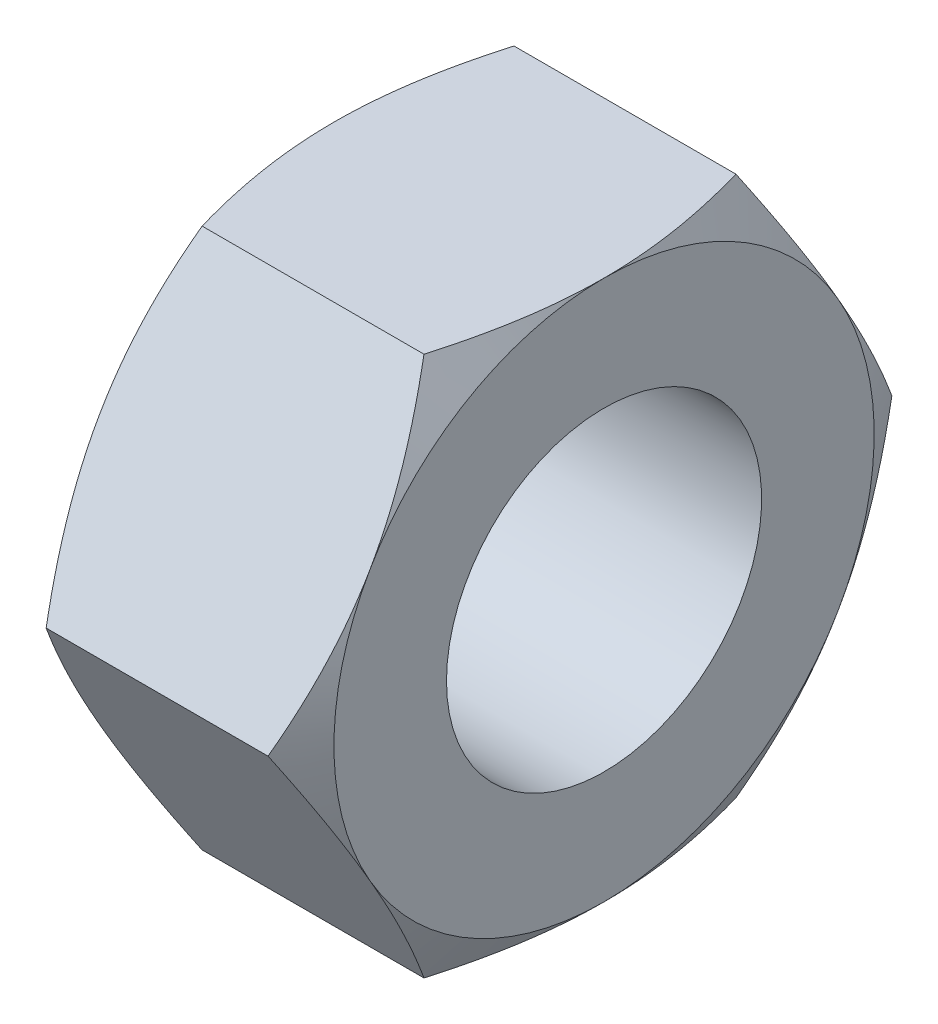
from build123d import *

# Parameters (mm, degrees)
SKETCH_H_OUTSIDE_W = 37.912
SKETCH_H_OUTSIDE_H = 37.912
HEXAGONE_DEPTH     = 23.978740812


with BuildPart() as part:
    # Contour → Base-R_volution (revolve)
    with BuildSketch(Plane.XY, mode=Mode.PRIVATE) as base_r_volution_sk:
        Polygon((0, 7), (-12, 7), (-12, 12), (-10.927968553, 13.856812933), (-1.072031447, 13.856812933), (0, 12), align=None)
    revolve(base_r_volution_sk.sketch.rotate(Axis((-30, 0, 0), (1, 0, 0)), 90), axis=Axis((-30, 0, 0), (1, 0, 0)))

    # Sketch H outside → Hexagone (cut, through all)
    with BuildSketch(Plane.ZY.offset(12)):
        Rectangle(SKETCH_H_OUTSIDE_W, SKETCH_H_OUTSIDE_H)
        Polygon((13.856406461, 0), (6.92820323, 12), (-6.92820323, 12), (-13.856406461, 0), (-6.92820323, -12), (6.92820323, -12), align=None, mode=Mode.SUBTRACT)
    extrude(amount=-HEXAGONE_DEPTH, mode=Mode.SUBTRACT)


solid = part.part
